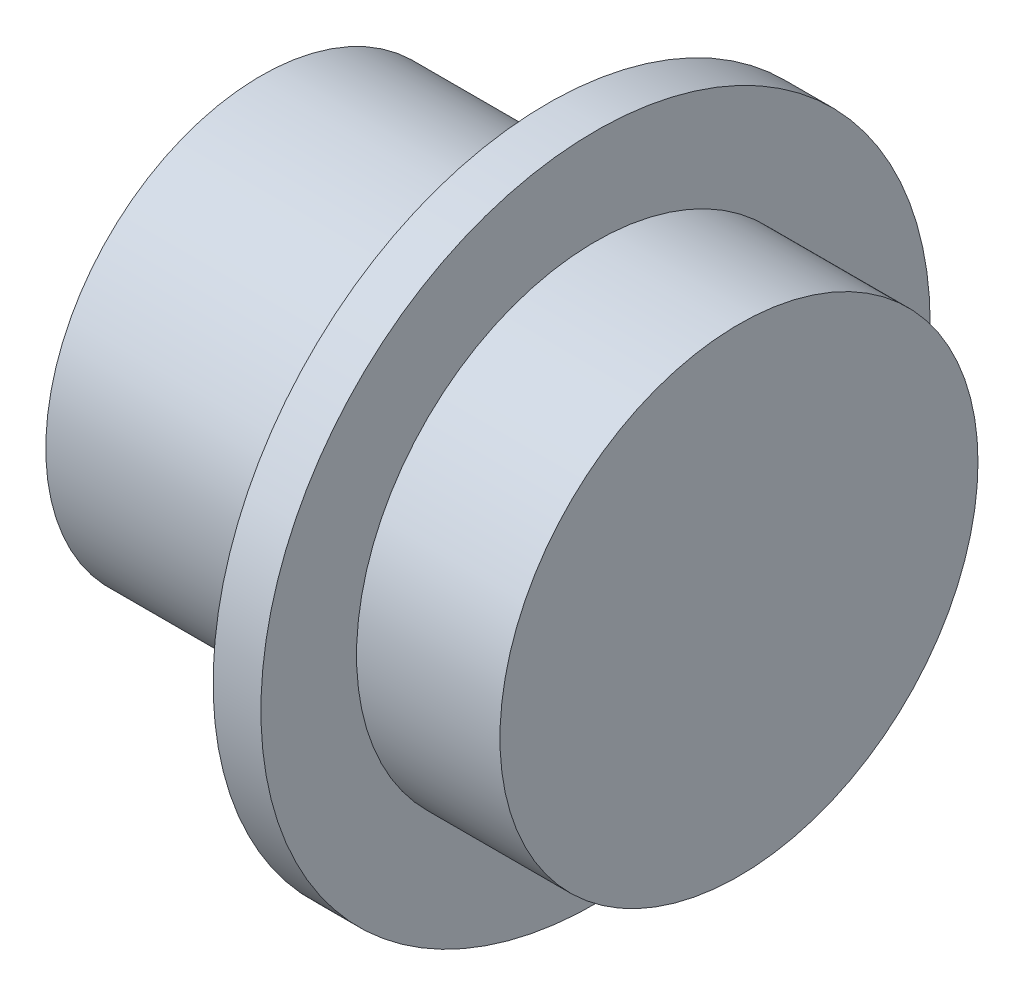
from build123d import *


with BuildPart() as part:
    # Sketch 1 → Revolve 1 (revolve)
    with BuildSketch(Plane.XY, mode=Mode.PRIVATE) as revolve_1_sk:
        Polygon((51, 22.5), (57, 22.5), (57, 25), (58, 25), (58, 23), (61, 23), (61, 18), (51, 18), align=None)
    revolve(revolve_1_sk.sketch.rotate(Axis((58, 18, 0), (-1, 0, 0)), 90), axis=Axis((58, 18, 0), (-1, 0, 0)))


solid = part.part
